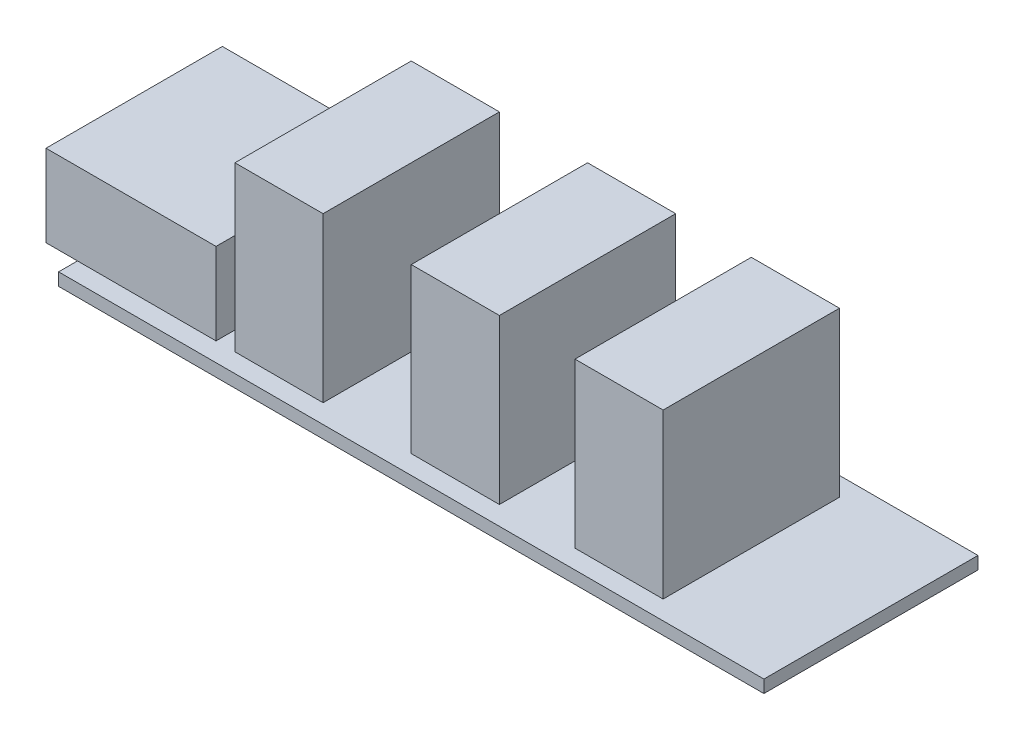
ISO-10303-21;
HEADER;
FILE_DESCRIPTION(('STEP AP214'),'2;1');
FILE_NAME('part.step','',(''),(''),'','','');
FILE_SCHEMA(('AUTOMOTIVE_DESIGN { 1 0 10303 214 1 1 1 1 }'));
ENDSEC;
DATA;
#1=APPLICATION_CONTEXT('core data for automotive mechanical design processes');
#2=APPLICATION_PROTOCOL_DEFINITION('international standard','automotive_design',2000,#1);
#3=PRODUCT_CONTEXT('',#1,'mechanical');
#4=PRODUCT('Part','Part','',(#3));
#5=PRODUCT_RELATED_PRODUCT_CATEGORY('part','',(#4));
#6=PRODUCT_DEFINITION_FORMATION('','',#4);
#7=PRODUCT_DEFINITION_CONTEXT('part definition',#1,'design');
#8=PRODUCT_DEFINITION('design','',#6,#7);
#9=PRODUCT_DEFINITION_SHAPE('','',#8);
#10=(LENGTH_UNIT() NAMED_UNIT(*) SI_UNIT(.MILLI.,.METRE.));
#11=(NAMED_UNIT(*) PLANE_ANGLE_UNIT() SI_UNIT($,.RADIAN.));
#12=(NAMED_UNIT(*) SI_UNIT($,.STERADIAN.) SOLID_ANGLE_UNIT());
#13=UNCERTAINTY_MEASURE_WITH_UNIT(LENGTH_MEASURE(1.E-05),#10,'distance_accuracy_value','');
#14=(GEOMETRIC_REPRESENTATION_CONTEXT(3) GLOBAL_UNCERTAINTY_ASSIGNED_CONTEXT((#13)) GLOBAL_UNIT_ASSIGNED_CONTEXT((#10,
#11,#12)) REPRESENTATION_CONTEXT('',''));
#15=CARTESIAN_POINT('',(0.,0.,0.));
#16=DIRECTION('',(0.,0.,1.));
#17=DIRECTION('',(1.,0.,0.));
#18=AXIS2_PLACEMENT_3D('',#15,#16,#17);
#19=CARTESIAN_POINT('',(0.,1.,0.));
#20=DIRECTION('',(0.,-1.,0.));
#21=DIRECTION('',(0.,0.,-1.));
#22=AXIS2_PLACEMENT_3D('',#19,#20,#21);
#23=PLANE('',#22);
#24=DIRECTION('',(0.,0.,1.));
#25=VECTOR('',#24,1.);
#26=CARTESIAN_POINT('',(26.5,1.,-1.50000000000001));
#27=LINE('',#26,#25);
#28=CARTESIAN_POINT('',(26.5,1.,-15.5));
#29=VERTEX_POINT('',#28);
#30=CARTESIAN_POINT('',(26.5,1.,-1.50000000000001));
#31=VERTEX_POINT('',#30);
#32=EDGE_CURVE('E237',#29,#31,#27,.T.);
#33=ORIENTED_EDGE('',*,*,#32,.F.);
#34=DIRECTION('',(-1.,0.,0.));
#35=VECTOR('',#34,1.);
#36=CARTESIAN_POINT('',(33.5,1.,-15.5));
#37=LINE('',#36,#35);
#38=CARTESIAN_POINT('',(33.5,1.,-15.5));
#39=VERTEX_POINT('',#38);
#40=EDGE_CURVE('E227',#39,#29,#37,.T.);
#41=ORIENTED_EDGE('',*,*,#40,.F.);
#42=DIRECTION('',(0.,0.,-1.));
#43=VECTOR('',#42,1.);
#44=CARTESIAN_POINT('',(33.5,1.,-1.50000000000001));
#45=LINE('',#44,#43);
#46=CARTESIAN_POINT('',(33.5,1.,-1.50000000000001));
#47=VERTEX_POINT('',#46);
#48=EDGE_CURVE('E230',#47,#39,#45,.T.);
#49=ORIENTED_EDGE('',*,*,#48,.F.);
#50=DIRECTION('',(1.,0.,0.));
#51=VECTOR('',#50,1.);
#52=CARTESIAN_POINT('',(33.5,1.,-1.50000000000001));
#53=LINE('',#52,#51);
#54=EDGE_CURVE('E234',#31,#47,#53,.T.);
#55=ORIENTED_EDGE('',*,*,#54,.F.);
#56=EDGE_LOOP('',(#33,#41,#49,#55));
#57=FACE_BOUND('',#56,.T.);
#58=DIRECTION('',(-1.,0.,0.));
#59=VECTOR('',#58,1.);
#60=CARTESIAN_POINT('',(11.,1.,-15.5));
#61=LINE('',#60,#59);
#62=CARTESIAN_POINT('',(11.,1.,-15.5));
#63=VERTEX_POINT('',#62);
#64=CARTESIAN_POINT('',(0.,1.,-15.5));
#65=VERTEX_POINT('',#64);
#66=EDGE_CURVE('E283',#63,#65,#61,.T.);
#67=ORIENTED_EDGE('',*,*,#66,.F.);
#68=DIRECTION('',(0.,0.,-1.));
#69=VECTOR('',#68,1.);
#70=CARTESIAN_POINT('',(11.,1.,-1.49999999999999));
#71=LINE('',#70,#69);
#72=CARTESIAN_POINT('',(11.,1.,-1.49999999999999));
#73=VERTEX_POINT('',#72);
#74=EDGE_CURVE('E291',#73,#63,#71,.T.);
#75=ORIENTED_EDGE('',*,*,#74,.F.);
#76=DIRECTION('',(1.,0.,0.));
#77=VECTOR('',#76,1.);
#78=CARTESIAN_POINT('',(11.,1.,-1.49999999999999));
#79=LINE('',#78,#77);
#80=CARTESIAN_POINT('',(0.,1.,-1.49999999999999));
#81=VERTEX_POINT('',#80);
#82=EDGE_CURVE('E11',#81,#73,#79,.T.);
#83=ORIENTED_EDGE('',*,*,#82,.F.);
#84=DIRECTION('',(0.,0.,1.));
#85=VECTOR('',#84,1.);
#86=CARTESIAN_POINT('',(0.,1.,0.));
#87=LINE('',#86,#85);
#88=CARTESIAN_POINT('',(0.,1.,0.));
#89=VERTEX_POINT('',#88);
#90=EDGE_CURVE('E314',#81,#89,#87,.T.);
#91=ORIENTED_EDGE('',*,*,#90,.T.);
#92=DIRECTION('',(1.,0.,0.));
#93=VECTOR('',#92,1.);
#94=CARTESIAN_POINT('',(0.,1.,0.));
#95=LINE('',#94,#93);
#96=CARTESIAN_POINT('',(56.,1.,0.));
#97=VERTEX_POINT('',#96);
#98=EDGE_CURVE('E312',#89,#97,#95,.T.);
#99=ORIENTED_EDGE('',*,*,#98,.T.);
#100=DIRECTION('',(0.,0.,-1.));
#101=VECTOR('',#100,1.);
#102=CARTESIAN_POINT('',(56.,1.,0.));
#103=LINE('',#102,#101);
#104=CARTESIAN_POINT('',(56.,1.,-17.));
#105=VERTEX_POINT('',#104);
#106=EDGE_CURVE('E316',#97,#105,#103,.T.);
#107=ORIENTED_EDGE('',*,*,#106,.T.);
#108=DIRECTION('',(-1.,0.,0.));
#109=VECTOR('',#108,1.);
#110=CARTESIAN_POINT('',(0.,1.,-17.));
#111=LINE('',#110,#109);
#112=CARTESIAN_POINT('',(0.,1.,-17.));
#113=VERTEX_POINT('',#112);
#114=EDGE_CURVE('E318',#105,#113,#111,.T.);
#115=ORIENTED_EDGE('',*,*,#114,.T.);
#116=EDGE_CURVE('E309',#113,#65,#87,.T.);
#117=ORIENTED_EDGE('',*,*,#116,.T.);
#118=EDGE_LOOP('',(#67,#75,#83,#91,#99,#107,#115,#117));
#119=FACE_BOUND('',#118,.T.);
#120=DIRECTION('',(0.,0.,1.));
#121=VECTOR('',#120,1.);
#122=CARTESIAN_POINT('',(39.5,1.,-1.50000000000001));
#123=LINE('',#122,#121);
#124=CARTESIAN_POINT('',(39.5,1.,-15.5));
#125=VERTEX_POINT('',#124);
#126=CARTESIAN_POINT('',(39.5,1.,-1.50000000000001));
#127=VERTEX_POINT('',#126);
#128=EDGE_CURVE('E217',#125,#127,#123,.T.);
#129=ORIENTED_EDGE('',*,*,#128,.F.);
#130=DIRECTION('',(-1.,0.,0.));
#131=VECTOR('',#130,1.);
#132=CARTESIAN_POINT('',(46.5,1.,-15.5));
#133=LINE('',#132,#131);
#134=CARTESIAN_POINT('',(46.5,1.,-15.5));
#135=VERTEX_POINT('',#134);
#136=EDGE_CURVE('E260',#135,#125,#133,.T.);
#137=ORIENTED_EDGE('',*,*,#136,.F.);
#138=DIRECTION('',(0.,0.,-1.));
#139=VECTOR('',#138,1.);
#140=CARTESIAN_POINT('',(46.5,1.,-1.50000000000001));
#141=LINE('',#140,#139);
#142=CARTESIAN_POINT('',(46.5,1.,-1.50000000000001));
#143=VERTEX_POINT('',#142);
#144=EDGE_CURVE('E263',#143,#135,#141,.T.);
#145=ORIENTED_EDGE('',*,*,#144,.F.);
#146=DIRECTION('',(1.,0.,0.));
#147=VECTOR('',#146,1.);
#148=CARTESIAN_POINT('',(46.5,1.,-1.50000000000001));
#149=LINE('',#148,#147);
#150=EDGE_CURVE('E267',#127,#143,#149,.T.);
#151=ORIENTED_EDGE('',*,*,#150,.F.);
#152=EDGE_LOOP('',(#129,#137,#145,#151));
#153=FACE_BOUND('',#152,.T.);
#154=DIRECTION('',(0.,0.,1.));
#155=VECTOR('',#154,1.);
#156=CARTESIAN_POINT('',(12.5,1.,-1.50000000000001));
#157=LINE('',#156,#155);
#158=CARTESIAN_POINT('',(12.5,1.,-15.5));
#159=VERTEX_POINT('',#158);
#160=CARTESIAN_POINT('',(12.5,1.,-1.50000000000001));
#161=VERTEX_POINT('',#160);
#162=EDGE_CURVE('E204',#159,#161,#157,.T.);
#163=ORIENTED_EDGE('',*,*,#162,.F.);
#164=DIRECTION('',(-1.,0.,0.));
#165=VECTOR('',#164,1.);
#166=CARTESIAN_POINT('',(19.5,1.,-15.5));
#167=LINE('',#166,#165);
#168=CARTESIAN_POINT('',(19.5,1.,-15.5));
#169=VERTEX_POINT('',#168);
#170=EDGE_CURVE('E201',#169,#159,#167,.T.);
#171=ORIENTED_EDGE('',*,*,#170,.F.);
#172=DIRECTION('',(0.,0.,-1.));
#173=VECTOR('',#172,1.);
#174=CARTESIAN_POINT('',(19.5,1.,-1.50000000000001));
#175=LINE('',#174,#173);
#176=CARTESIAN_POINT('',(19.5,1.,-1.50000000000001));
#177=VERTEX_POINT('',#176);
#178=EDGE_CURVE('E61',#177,#169,#175,.T.);
#179=ORIENTED_EDGE('',*,*,#178,.F.);
#180=DIRECTION('',(1.,0.,0.));
#181=VECTOR('',#180,1.);
#182=CARTESIAN_POINT('',(19.5,1.,-1.50000000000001));
#183=LINE('',#182,#181);
#184=EDGE_CURVE('E56',#161,#177,#183,.T.);
#185=ORIENTED_EDGE('',*,*,#184,.F.);
#186=EDGE_LOOP('',(#163,#171,#179,#185));
#187=FACE_BOUND('',#186,.T.);
#188=ADVANCED_FACE('F39',(#57,#119,#153,#187),#23,.F.);
#189=CARTESIAN_POINT('',(0.,1.,0.));
#190=DIRECTION('',(1.,0.,0.));
#191=DIRECTION('',(0.,0.,-1.));
#192=AXIS2_PLACEMENT_3D('',#189,#190,#191);
#193=PLANE('',#192);
#194=DIRECTION('',(0.,0.,1.));
#195=VECTOR('',#194,1.);
#196=CARTESIAN_POINT('',(0.,0.,0.));
#197=LINE('',#196,#195);
#198=CARTESIAN_POINT('',(0.,0.,-17.));
#199=VERTEX_POINT('',#198);
#200=CARTESIAN_POINT('',(0.,0.,0.));
#201=VERTEX_POINT('',#200);
#202=EDGE_CURVE('E308',#199,#201,#197,.T.);
#203=ORIENTED_EDGE('',*,*,#202,.T.);
#204=DIRECTION('',(0.,-1.,0.));
#205=VECTOR('',#204,1.);
#206=CARTESIAN_POINT('',(0.,1.,0.));
#207=LINE('',#206,#205);
#208=EDGE_CURVE('E43',#89,#201,#207,.T.);
#209=ORIENTED_EDGE('',*,*,#208,.F.);
#210=ORIENTED_EDGE('',*,*,#90,.F.);
#211=EDGE_CURVE('E313',#65,#81,#87,.T.);
#212=ORIENTED_EDGE('',*,*,#211,.F.);
#213=ORIENTED_EDGE('',*,*,#116,.F.);
#214=DIRECTION('',(0.,-1.,0.));
#215=VECTOR('',#214,1.);
#216=CARTESIAN_POINT('',(0.,1.,-17.));
#217=LINE('',#216,#215);
#218=EDGE_CURVE('E320',#113,#199,#217,.T.);
#219=ORIENTED_EDGE('',*,*,#218,.T.);
#220=EDGE_LOOP('',(#203,#209,#210,#212,#213,#219));
#221=FACE_BOUND('',#220,.T.);
#222=ADVANCED_FACE('F41',(#221),#193,.F.);
#223=CARTESIAN_POINT('',(0.,1.,0.));
#224=DIRECTION('',(0.,0.,-1.));
#225=DIRECTION('',(-1.,0.,0.));
#226=AXIS2_PLACEMENT_3D('',#223,#224,#225);
#227=PLANE('',#226);
#228=DIRECTION('',(1.,0.,0.));
#229=VECTOR('',#228,1.);
#230=CARTESIAN_POINT('',(0.,0.,0.));
#231=LINE('',#230,#229);
#232=CARTESIAN_POINT('',(56.,0.,0.));
#233=VERTEX_POINT('',#232);
#234=EDGE_CURVE('E323',#201,#233,#231,.T.);
#235=ORIENTED_EDGE('',*,*,#234,.T.);
#236=DIRECTION('',(0.,-1.,0.));
#237=VECTOR('',#236,1.);
#238=CARTESIAN_POINT('',(56.,1.,0.));
#239=LINE('',#238,#237);
#240=EDGE_CURVE('E333',#97,#233,#239,.T.);
#241=ORIENTED_EDGE('',*,*,#240,.F.);
#242=ORIENTED_EDGE('',*,*,#98,.F.);
#243=ORIENTED_EDGE('',*,*,#208,.T.);
#244=EDGE_LOOP('',(#235,#241,#242,#243));
#245=FACE_BOUND('',#244,.T.);
#246=ADVANCED_FACE('F343',(#245),#227,.F.);
#247=CARTESIAN_POINT('',(56.,1.,0.));
#248=DIRECTION('',(-1.,0.,0.));
#249=DIRECTION('',(0.,0.,1.));
#250=AXIS2_PLACEMENT_3D('',#247,#248,#249);
#251=PLANE('',#250);
#252=DIRECTION('',(0.,0.,-1.));
#253=VECTOR('',#252,1.);
#254=CARTESIAN_POINT('',(56.,0.,0.));
#255=LINE('',#254,#253);
#256=CARTESIAN_POINT('',(56.,0.,-17.));
#257=VERTEX_POINT('',#256);
#258=EDGE_CURVE('E325',#233,#257,#255,.T.);
#259=ORIENTED_EDGE('',*,*,#258,.T.);
#260=DIRECTION('',(0.,-1.,0.));
#261=VECTOR('',#260,1.);
#262=CARTESIAN_POINT('',(56.,1.,-17.));
#263=LINE('',#262,#261);
#264=EDGE_CURVE('E331',#105,#257,#263,.T.);
#265=ORIENTED_EDGE('',*,*,#264,.F.);
#266=ORIENTED_EDGE('',*,*,#106,.F.);
#267=ORIENTED_EDGE('',*,*,#240,.T.);
#268=EDGE_LOOP('',(#259,#265,#266,#267));
#269=FACE_BOUND('',#268,.T.);
#270=ADVANCED_FACE('F353',(#269),#251,.F.);
#271=CARTESIAN_POINT('',(0.,1.,-17.));
#272=DIRECTION('',(0.,0.,1.));
#273=DIRECTION('',(1.,0.,0.));
#274=AXIS2_PLACEMENT_3D('',#271,#272,#273);
#275=PLANE('',#274);
#276=DIRECTION('',(-1.,0.,0.));
#277=VECTOR('',#276,1.);
#278=CARTESIAN_POINT('',(0.,0.,-17.));
#279=LINE('',#278,#277);
#280=EDGE_CURVE('E327',#257,#199,#279,.T.);
#281=ORIENTED_EDGE('',*,*,#280,.T.);
#282=ORIENTED_EDGE('',*,*,#218,.F.);
#283=ORIENTED_EDGE('',*,*,#114,.F.);
#284=ORIENTED_EDGE('',*,*,#264,.T.);
#285=EDGE_LOOP('',(#281,#282,#283,#284));
#286=FACE_BOUND('',#285,.T.);
#287=ADVANCED_FACE('F356',(#286),#275,.F.);
#288=CARTESIAN_POINT('',(0.,0.,0.));
#289=DIRECTION('',(0.,-1.,0.));
#290=DIRECTION('',(0.,0.,-1.));
#291=AXIS2_PLACEMENT_3D('',#288,#289,#290);
#292=PLANE('',#291);
#293=ORIENTED_EDGE('',*,*,#202,.F.);
#294=ORIENTED_EDGE('',*,*,#280,.F.);
#295=ORIENTED_EDGE('',*,*,#258,.F.);
#296=ORIENTED_EDGE('',*,*,#234,.F.);
#297=EDGE_LOOP('',(#293,#294,#295,#296));
#298=FACE_BOUND('',#297,.T.);
#299=ADVANCED_FACE('F351',(#298),#292,.T.);
#300=CARTESIAN_POINT('',(0.,1.,0.));
#301=DIRECTION('',(0.,1.,0.));
#302=DIRECTION('',(0.,0.,1.));
#303=AXIS2_PLACEMENT_3D('',#300,#301,#302);
#304=PLANE('',#303);
#305=CARTESIAN_POINT('',(-2.5,1.,-15.5));
#306=VERTEX_POINT('',#305);
#307=EDGE_CURVE('E294',#65,#306,#61,.T.);
#308=ORIENTED_EDGE('',*,*,#307,.F.);
#309=ORIENTED_EDGE('',*,*,#211,.T.);
#310=CARTESIAN_POINT('',(-2.5,1.,-1.49999999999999));
#311=VERTEX_POINT('',#310);
#312=EDGE_CURVE('E49',#311,#81,#79,.T.);
#313=ORIENTED_EDGE('',*,*,#312,.F.);
#314=DIRECTION('',(0.,0.,1.));
#315=VECTOR('',#314,1.);
#316=CARTESIAN_POINT('',(-2.5,1.,-1.49999999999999));
#317=LINE('',#316,#315);
#318=EDGE_CURVE('E205',#306,#311,#317,.T.);
#319=ORIENTED_EDGE('',*,*,#318,.F.);
#320=EDGE_LOOP('',(#308,#309,#313,#319));
#321=FACE_BOUND('',#320,.T.);
#322=ADVANCED_FACE('F362',(#321),#304,.F.);
#323=CARTESIAN_POINT('',(-2.5,7.5,-1.49999999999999));
#324=DIRECTION('',(1.,0.,0.));
#325=DIRECTION('',(0.,0.,-1.));
#326=AXIS2_PLACEMENT_3D('',#323,#324,#325);
#327=PLANE('',#326);
#328=ORIENTED_EDGE('',*,*,#318,.T.);
#329=DIRECTION('',(0.,-1.,0.));
#330=VECTOR('',#329,1.);
#331=CARTESIAN_POINT('',(-2.5,7.5,-1.49999999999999));
#332=LINE('',#331,#330);
#333=CARTESIAN_POINT('',(-2.5,7.5,-1.49999999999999));
#334=VERTEX_POINT('',#333);
#335=EDGE_CURVE('E305',#334,#311,#332,.T.);
#336=ORIENTED_EDGE('',*,*,#335,.F.);
#337=DIRECTION('',(0.,0.,1.));
#338=VECTOR('',#337,1.);
#339=CARTESIAN_POINT('',(-2.5,7.5,-1.49999999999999));
#340=LINE('',#339,#338);
#341=CARTESIAN_POINT('',(-2.5,7.5,-15.5));
#342=VERTEX_POINT('',#341);
#343=EDGE_CURVE('E279',#342,#334,#340,.T.);
#344=ORIENTED_EDGE('',*,*,#343,.F.);
#345=DIRECTION('',(0.,-1.,0.));
#346=VECTOR('',#345,1.);
#347=CARTESIAN_POINT('',(-2.5,7.5,-15.5));
#348=LINE('',#347,#346);
#349=EDGE_CURVE('E288',#342,#306,#348,.T.);
#350=ORIENTED_EDGE('',*,*,#349,.T.);
#351=EDGE_LOOP('',(#328,#336,#344,#350));
#352=FACE_BOUND('',#351,.T.);
#353=ADVANCED_FACE('F370',(#352),#327,.F.);
#354=CARTESIAN_POINT('',(11.,7.5,-1.49999999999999));
#355=DIRECTION('',(0.,0.,-1.));
#356=DIRECTION('',(-1.,0.,0.));
#357=AXIS2_PLACEMENT_3D('',#354,#355,#356);
#358=PLANE('',#357);
#359=ORIENTED_EDGE('',*,*,#312,.T.);
#360=ORIENTED_EDGE('',*,*,#82,.T.);
#361=DIRECTION('',(0.,-1.,0.));
#362=VECTOR('',#361,1.);
#363=CARTESIAN_POINT('',(11.,7.5,-1.49999999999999));
#364=LINE('',#363,#362);
#365=CARTESIAN_POINT('',(11.,7.5,-1.49999999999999));
#366=VERTEX_POINT('',#365);
#367=EDGE_CURVE('E302',#366,#73,#364,.T.);
#368=ORIENTED_EDGE('',*,*,#367,.F.);
#369=DIRECTION('',(1.,0.,0.));
#370=VECTOR('',#369,1.);
#371=CARTESIAN_POINT('',(11.,7.5,-1.49999999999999));
#372=LINE('',#371,#370);
#373=EDGE_CURVE('E282',#334,#366,#372,.T.);
#374=ORIENTED_EDGE('',*,*,#373,.F.);
#375=ORIENTED_EDGE('',*,*,#335,.T.);
#376=EDGE_LOOP('',(#359,#360,#368,#374,#375));
#377=FACE_BOUND('',#376,.T.);
#378=ADVANCED_FACE('F365',(#377),#358,.F.);
#379=CARTESIAN_POINT('',(11.,7.5,-1.49999999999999));
#380=DIRECTION('',(-1.,0.,0.));
#381=DIRECTION('',(0.,0.,1.));
#382=AXIS2_PLACEMENT_3D('',#379,#380,#381);
#383=PLANE('',#382);
#384=ORIENTED_EDGE('',*,*,#74,.T.);
#385=DIRECTION('',(0.,-1.,0.));
#386=VECTOR('',#385,1.);
#387=CARTESIAN_POINT('',(11.,7.5,-15.5));
#388=LINE('',#387,#386);
#389=CARTESIAN_POINT('',(11.,7.5,-15.5));
#390=VERTEX_POINT('',#389);
#391=EDGE_CURVE('E299',#390,#63,#388,.T.);
#392=ORIENTED_EDGE('',*,*,#391,.F.);
#393=DIRECTION('',(0.,0.,-1.));
#394=VECTOR('',#393,1.);
#395=CARTESIAN_POINT('',(11.,7.5,-1.49999999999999));
#396=LINE('',#395,#394);
#397=EDGE_CURVE('E285',#366,#390,#396,.T.);
#398=ORIENTED_EDGE('',*,*,#397,.F.);
#399=ORIENTED_EDGE('',*,*,#367,.T.);
#400=EDGE_LOOP('',(#384,#392,#398,#399));
#401=FACE_BOUND('',#400,.T.);
#402=ADVANCED_FACE('F377',(#401),#383,.F.);
#403=CARTESIAN_POINT('',(11.,7.5,-15.5));
#404=DIRECTION('',(0.,0.,1.));
#405=DIRECTION('',(1.,0.,0.));
#406=AXIS2_PLACEMENT_3D('',#403,#404,#405);
#407=PLANE('',#406);
#408=ORIENTED_EDGE('',*,*,#66,.T.);
#409=ORIENTED_EDGE('',*,*,#307,.T.);
#410=ORIENTED_EDGE('',*,*,#349,.F.);
#411=DIRECTION('',(-1.,0.,0.));
#412=VECTOR('',#411,1.);
#413=CARTESIAN_POINT('',(11.,7.5,-15.5));
#414=LINE('',#413,#412);
#415=EDGE_CURVE('E287',#390,#342,#414,.T.);
#416=ORIENTED_EDGE('',*,*,#415,.F.);
#417=ORIENTED_EDGE('',*,*,#391,.T.);
#418=EDGE_LOOP('',(#408,#409,#410,#416,#417));
#419=FACE_BOUND('',#418,.T.);
#420=ADVANCED_FACE('F374',(#419),#407,.F.);
#421=CARTESIAN_POINT('',(0.,7.5,0.));
#422=DIRECTION('',(0.,1.,0.));
#423=DIRECTION('',(0.,0.,1.));
#424=AXIS2_PLACEMENT_3D('',#421,#422,#423);
#425=PLANE('',#424);
#426=ORIENTED_EDGE('',*,*,#343,.T.);
#427=ORIENTED_EDGE('',*,*,#373,.T.);
#428=ORIENTED_EDGE('',*,*,#397,.T.);
#429=ORIENTED_EDGE('',*,*,#415,.T.);
#430=EDGE_LOOP('',(#426,#427,#428,#429));
#431=FACE_BOUND('',#430,.T.);
#432=ADVANCED_FACE('F380',(#431),#425,.T.);
#433=CARTESIAN_POINT('',(39.5,14.,-1.50000000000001));
#434=DIRECTION('',(1.,0.,0.));
#435=DIRECTION('',(0.,0.,-1.));
#436=AXIS2_PLACEMENT_3D('',#433,#434,#435);
#437=PLANE('',#436);
#438=ORIENTED_EDGE('',*,*,#128,.T.);
#439=DIRECTION('',(0.,-1.,0.));
#440=VECTOR('',#439,1.);
#441=CARTESIAN_POINT('',(39.5,14.,-1.50000000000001));
#442=LINE('',#441,#440);
#443=CARTESIAN_POINT('',(39.5,14.,-1.50000000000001));
#444=VERTEX_POINT('',#443);
#445=EDGE_CURVE('E247',#444,#127,#442,.T.);
#446=ORIENTED_EDGE('',*,*,#445,.F.);
#447=DIRECTION('',(0.,0.,1.));
#448=VECTOR('',#447,1.);
#449=CARTESIAN_POINT('',(39.5,14.,-1.50000000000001));
#450=LINE('',#449,#448);
#451=CARTESIAN_POINT('',(39.5,14.,-15.5));
#452=VERTEX_POINT('',#451);
#453=EDGE_CURVE('E264',#452,#444,#450,.T.);
#454=ORIENTED_EDGE('',*,*,#453,.F.);
#455=DIRECTION('',(0.,-1.,0.));
#456=VECTOR('',#455,1.);
#457=CARTESIAN_POINT('',(39.5,14.,-15.5));
#458=LINE('',#457,#456);
#459=EDGE_CURVE('E256',#452,#125,#458,.T.);
#460=ORIENTED_EDGE('',*,*,#459,.T.);
#461=EDGE_LOOP('',(#438,#446,#454,#460));
#462=FACE_BOUND('',#461,.T.);
#463=ADVANCED_FACE('F382',(#462),#437,.F.);
#464=CARTESIAN_POINT('',(46.5,14.,-1.50000000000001));
#465=DIRECTION('',(0.,0.,-1.));
#466=DIRECTION('',(-1.,0.,0.));
#467=AXIS2_PLACEMENT_3D('',#464,#465,#466);
#468=PLANE('',#467);
#469=ORIENTED_EDGE('',*,*,#150,.T.);
#470=DIRECTION('',(0.,-1.,0.));
#471=VECTOR('',#470,1.);
#472=CARTESIAN_POINT('',(46.5,14.,-1.50000000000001));
#473=LINE('',#472,#471);
#474=CARTESIAN_POINT('',(46.5,14.,-1.50000000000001));
#475=VERTEX_POINT('',#474);
#476=EDGE_CURVE('E250',#475,#143,#473,.T.);
#477=ORIENTED_EDGE('',*,*,#476,.F.);
#478=DIRECTION('',(1.,0.,0.));
#479=VECTOR('',#478,1.);
#480=CARTESIAN_POINT('',(46.5,14.,-1.50000000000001));
#481=LINE('',#480,#479);
#482=EDGE_CURVE('E275',#444,#475,#481,.T.);
#483=ORIENTED_EDGE('',*,*,#482,.F.);
#484=ORIENTED_EDGE('',*,*,#445,.T.);
#485=EDGE_LOOP('',(#469,#477,#483,#484));
#486=FACE_BOUND('',#485,.T.);
#487=ADVANCED_FACE('F389',(#486),#468,.F.);
#488=CARTESIAN_POINT('',(46.5,14.,-1.50000000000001));
#489=DIRECTION('',(-1.,0.,0.));
#490=DIRECTION('',(0.,0.,1.));
#491=AXIS2_PLACEMENT_3D('',#488,#489,#490);
#492=PLANE('',#491);
#493=ORIENTED_EDGE('',*,*,#144,.T.);
#494=DIRECTION('',(0.,-1.,0.));
#495=VECTOR('',#494,1.);
#496=CARTESIAN_POINT('',(46.5,14.,-15.5));
#497=LINE('',#496,#495);
#498=CARTESIAN_POINT('',(46.5,14.,-15.5));
#499=VERTEX_POINT('',#498);
#500=EDGE_CURVE('E253',#499,#135,#497,.T.);
#501=ORIENTED_EDGE('',*,*,#500,.F.);
#502=DIRECTION('',(0.,0.,-1.));
#503=VECTOR('',#502,1.);
#504=CARTESIAN_POINT('',(46.5,14.,-1.50000000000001));
#505=LINE('',#504,#503);
#506=EDGE_CURVE('E273',#475,#499,#505,.T.);
#507=ORIENTED_EDGE('',*,*,#506,.F.);
#508=ORIENTED_EDGE('',*,*,#476,.T.);
#509=EDGE_LOOP('',(#493,#501,#507,#508));
#510=FACE_BOUND('',#509,.T.);
#511=ADVANCED_FACE('F485',(#510),#492,.F.);
#512=CARTESIAN_POINT('',(46.5,14.,-15.5));
#513=DIRECTION('',(0.,0.,1.));
#514=DIRECTION('',(1.,0.,0.));
#515=AXIS2_PLACEMENT_3D('',#512,#513,#514);
#516=PLANE('',#515);
#517=ORIENTED_EDGE('',*,*,#136,.T.);
#518=ORIENTED_EDGE('',*,*,#459,.F.);
#519=DIRECTION('',(-1.,0.,0.));
#520=VECTOR('',#519,1.);
#521=CARTESIAN_POINT('',(46.5,14.,-15.5));
#522=LINE('',#521,#520);
#523=EDGE_CURVE('E259',#499,#452,#522,.T.);
#524=ORIENTED_EDGE('',*,*,#523,.F.);
#525=ORIENTED_EDGE('',*,*,#500,.T.);
#526=EDGE_LOOP('',(#517,#518,#524,#525));
#527=FACE_BOUND('',#526,.T.);
#528=ADVANCED_FACE('F495',(#527),#516,.F.);
#529=CARTESIAN_POINT('',(0.,14.,0.));
#530=DIRECTION('',(0.,1.,0.));
#531=DIRECTION('',(0.,0.,1.));
#532=AXIS2_PLACEMENT_3D('',#529,#530,#531);
#533=PLANE('',#532);
#534=ORIENTED_EDGE('',*,*,#453,.T.);
#535=ORIENTED_EDGE('',*,*,#482,.T.);
#536=ORIENTED_EDGE('',*,*,#506,.T.);
#537=ORIENTED_EDGE('',*,*,#523,.T.);
#538=EDGE_LOOP('',(#534,#535,#536,#537));
#539=FACE_BOUND('',#538,.T.);
#540=ADVANCED_FACE('F505',(#539),#533,.T.);
#541=CARTESIAN_POINT('',(26.5,14.,-1.50000000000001));
#542=DIRECTION('',(1.,0.,0.));
#543=DIRECTION('',(0.,0.,-1.));
#544=AXIS2_PLACEMENT_3D('',#541,#542,#543);
#545=PLANE('',#544);
#546=ORIENTED_EDGE('',*,*,#32,.T.);
#547=DIRECTION('',(0.,-1.,0.));
#548=VECTOR('',#547,1.);
#549=CARTESIAN_POINT('',(26.5,14.,-1.50000000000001));
#550=LINE('',#549,#548);
#551=CARTESIAN_POINT('',(26.5,14.,-1.50000000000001));
#552=VERTEX_POINT('',#551);
#553=EDGE_CURVE('E213',#552,#31,#550,.T.);
#554=ORIENTED_EDGE('',*,*,#553,.F.);
#555=DIRECTION('',(0.,0.,1.));
#556=VECTOR('',#555,1.);
#557=CARTESIAN_POINT('',(26.5,14.,-1.50000000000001));
#558=LINE('',#557,#556);
#559=CARTESIAN_POINT('',(26.5,14.,-15.5));
#560=VERTEX_POINT('',#559);
#561=EDGE_CURVE('E231',#560,#552,#558,.T.);
#562=ORIENTED_EDGE('',*,*,#561,.F.);
#563=DIRECTION('',(0.,-1.,0.));
#564=VECTOR('',#563,1.);
#565=CARTESIAN_POINT('',(26.5,14.,-15.5));
#566=LINE('',#565,#564);
#567=EDGE_CURVE('E223',#560,#29,#566,.T.);
#568=ORIENTED_EDGE('',*,*,#567,.T.);
#569=EDGE_LOOP('',(#546,#554,#562,#568));
#570=FACE_BOUND('',#569,.T.);
#571=ADVANCED_FACE('F515',(#570),#545,.F.);
#572=CARTESIAN_POINT('',(33.5,14.,-1.50000000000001));
#573=DIRECTION('',(0.,0.,-1.));
#574=DIRECTION('',(-1.,0.,0.));
#575=AXIS2_PLACEMENT_3D('',#572,#573,#574);
#576=PLANE('',#575);
#577=ORIENTED_EDGE('',*,*,#54,.T.);
#578=DIRECTION('',(0.,-1.,0.));
#579=VECTOR('',#578,1.);
#580=CARTESIAN_POINT('',(33.5,14.,-1.50000000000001));
#581=LINE('',#580,#579);
#582=CARTESIAN_POINT('',(33.5,14.,-1.50000000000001));
#583=VERTEX_POINT('',#582);
#584=EDGE_CURVE('E216',#583,#47,#581,.T.);
#585=ORIENTED_EDGE('',*,*,#584,.F.);
#586=DIRECTION('',(1.,0.,0.));
#587=VECTOR('',#586,1.);
#588=CARTESIAN_POINT('',(33.5,14.,-1.50000000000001));
#589=LINE('',#588,#587);
#590=EDGE_CURVE('E243',#552,#583,#589,.T.);
#591=ORIENTED_EDGE('',*,*,#590,.F.);
#592=ORIENTED_EDGE('',*,*,#553,.T.);
#593=EDGE_LOOP('',(#577,#585,#591,#592));
#594=FACE_BOUND('',#593,.T.);
#595=ADVANCED_FACE('F524',(#594),#576,.F.);
#596=CARTESIAN_POINT('',(33.5,14.,-1.50000000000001));
#597=DIRECTION('',(-1.,0.,0.));
#598=DIRECTION('',(0.,0.,1.));
#599=AXIS2_PLACEMENT_3D('',#596,#597,#598);
#600=PLANE('',#599);
#601=ORIENTED_EDGE('',*,*,#48,.T.);
#602=DIRECTION('',(0.,-1.,0.));
#603=VECTOR('',#602,1.);
#604=CARTESIAN_POINT('',(33.5,14.,-15.5));
#605=LINE('',#604,#603);
#606=CARTESIAN_POINT('',(33.5,14.,-15.5));
#607=VERTEX_POINT('',#606);
#608=EDGE_CURVE('E220',#607,#39,#605,.T.);
#609=ORIENTED_EDGE('',*,*,#608,.F.);
#610=DIRECTION('',(0.,0.,-1.));
#611=VECTOR('',#610,1.);
#612=CARTESIAN_POINT('',(33.5,14.,-1.50000000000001));
#613=LINE('',#612,#611);
#614=EDGE_CURVE('E241',#583,#607,#613,.T.);
#615=ORIENTED_EDGE('',*,*,#614,.F.);
#616=ORIENTED_EDGE('',*,*,#584,.T.);
#617=EDGE_LOOP('',(#601,#609,#615,#616));
#618=FACE_BOUND('',#617,.T.);
#619=ADVANCED_FACE('F534',(#618),#600,.F.);
#620=CARTESIAN_POINT('',(33.5,14.,-15.5));
#621=DIRECTION('',(0.,0.,1.));
#622=DIRECTION('',(1.,0.,0.));
#623=AXIS2_PLACEMENT_3D('',#620,#621,#622);
#624=PLANE('',#623);
#625=ORIENTED_EDGE('',*,*,#40,.T.);
#626=ORIENTED_EDGE('',*,*,#567,.F.);
#627=DIRECTION('',(-1.,0.,0.));
#628=VECTOR('',#627,1.);
#629=CARTESIAN_POINT('',(33.5,14.,-15.5));
#630=LINE('',#629,#628);
#631=EDGE_CURVE('E226',#607,#560,#630,.T.);
#632=ORIENTED_EDGE('',*,*,#631,.F.);
#633=ORIENTED_EDGE('',*,*,#608,.T.);
#634=EDGE_LOOP('',(#625,#626,#632,#633));
#635=FACE_BOUND('',#634,.T.);
#636=ADVANCED_FACE('F544',(#635),#624,.F.);
#637=CARTESIAN_POINT('',(0.,14.,0.));
#638=DIRECTION('',(0.,1.,0.));
#639=DIRECTION('',(0.,0.,1.));
#640=AXIS2_PLACEMENT_3D('',#637,#638,#639);
#641=PLANE('',#640);
#642=ORIENTED_EDGE('',*,*,#561,.T.);
#643=ORIENTED_EDGE('',*,*,#590,.T.);
#644=ORIENTED_EDGE('',*,*,#614,.T.);
#645=ORIENTED_EDGE('',*,*,#631,.T.);
#646=EDGE_LOOP('',(#642,#643,#644,#645));
#647=FACE_BOUND('',#646,.T.);
#648=ADVANCED_FACE('F554',(#647),#641,.T.);
#649=CARTESIAN_POINT('',(12.5,14.,-1.50000000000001));
#650=DIRECTION('',(1.,0.,0.));
#651=DIRECTION('',(0.,0.,-1.));
#652=AXIS2_PLACEMENT_3D('',#649,#650,#651);
#653=PLANE('',#652);
#654=ORIENTED_EDGE('',*,*,#162,.T.);
#655=DIRECTION('',(0.,-1.,0.));
#656=VECTOR('',#655,1.);
#657=CARTESIAN_POINT('',(12.5,14.,-1.50000000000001));
#658=LINE('',#657,#656);
#659=CARTESIAN_POINT('',(12.5,14.,-1.50000000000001));
#660=VERTEX_POINT('',#659);
#661=EDGE_CURVE('E185',#660,#161,#658,.T.);
#662=ORIENTED_EDGE('',*,*,#661,.F.);
#663=DIRECTION('',(0.,0.,1.));
#664=VECTOR('',#663,1.);
#665=CARTESIAN_POINT('',(12.5,14.,-1.50000000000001));
#666=LINE('',#665,#664);
#667=CARTESIAN_POINT('',(12.5,14.,-15.5));
#668=VERTEX_POINT('',#667);
#669=EDGE_CURVE('E192',#668,#660,#666,.T.);
#670=ORIENTED_EDGE('',*,*,#669,.F.);
#671=DIRECTION('',(0.,-1.,0.));
#672=VECTOR('',#671,1.);
#673=CARTESIAN_POINT('',(12.5,14.,-15.5));
#674=LINE('',#673,#672);
#675=EDGE_CURVE('E613',#668,#159,#674,.T.);
#676=ORIENTED_EDGE('',*,*,#675,.T.);
#677=EDGE_LOOP('',(#654,#662,#670,#676));
#678=FACE_BOUND('',#677,.T.);
#679=ADVANCED_FACE('F203',(#678),#653,.F.);
#680=CARTESIAN_POINT('',(19.5,14.,-1.50000000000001));
#681=DIRECTION('',(0.,0.,-1.));
#682=DIRECTION('',(-1.,0.,0.));
#683=AXIS2_PLACEMENT_3D('',#680,#681,#682);
#684=PLANE('',#683);
#685=ORIENTED_EDGE('',*,*,#184,.T.);
#686=DIRECTION('',(0.,-1.,0.));
#687=VECTOR('',#686,1.);
#688=CARTESIAN_POINT('',(19.5,14.,-1.50000000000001));
#689=LINE('',#688,#687);
#690=CARTESIAN_POINT('',(19.5,14.,-1.50000000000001));
#691=VERTEX_POINT('',#690);
#692=EDGE_CURVE('E188',#691,#177,#689,.T.);
#693=ORIENTED_EDGE('',*,*,#692,.F.);
#694=DIRECTION('',(1.,0.,0.));
#695=VECTOR('',#694,1.);
#696=CARTESIAN_POINT('',(19.5,14.,-1.50000000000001));
#697=LINE('',#696,#695);
#698=EDGE_CURVE('E181',#660,#691,#697,.T.);
#699=ORIENTED_EDGE('',*,*,#698,.F.);
#700=ORIENTED_EDGE('',*,*,#661,.T.);
#701=EDGE_LOOP('',(#685,#693,#699,#700));
#702=FACE_BOUND('',#701,.T.);
#703=ADVANCED_FACE('F183',(#702),#684,.F.);
#704=CARTESIAN_POINT('',(19.5,14.,-1.50000000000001));
#705=DIRECTION('',(-1.,0.,0.));
#706=DIRECTION('',(0.,0.,1.));
#707=AXIS2_PLACEMENT_3D('',#704,#705,#706);
#708=PLANE('',#707);
#709=ORIENTED_EDGE('',*,*,#178,.T.);
#710=DIRECTION('',(0.,-1.,0.));
#711=VECTOR('',#710,1.);
#712=CARTESIAN_POINT('',(19.5,14.,-15.5));
#713=LINE('',#712,#711);
#714=CARTESIAN_POINT('',(19.5,14.,-15.5));
#715=VERTEX_POINT('',#714);
#716=EDGE_CURVE('E209',#715,#169,#713,.T.);
#717=ORIENTED_EDGE('',*,*,#716,.F.);
#718=DIRECTION('',(0.,0.,-1.));
#719=VECTOR('',#718,1.);
#720=CARTESIAN_POINT('',(19.5,14.,-1.50000000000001));
#721=LINE('',#720,#719);
#722=EDGE_CURVE('E191',#691,#715,#721,.T.);
#723=ORIENTED_EDGE('',*,*,#722,.F.);
#724=ORIENTED_EDGE('',*,*,#692,.T.);
#725=EDGE_LOOP('',(#709,#717,#723,#724));
#726=FACE_BOUND('',#725,.T.);
#727=ADVANCED_FACE('F581',(#726),#708,.F.);
#728=CARTESIAN_POINT('',(19.5,14.,-15.5));
#729=DIRECTION('',(0.,0.,1.));
#730=DIRECTION('',(1.,0.,0.));
#731=AXIS2_PLACEMENT_3D('',#728,#729,#730);
#732=PLANE('',#731);
#733=ORIENTED_EDGE('',*,*,#170,.T.);
#734=ORIENTED_EDGE('',*,*,#675,.F.);
#735=DIRECTION('',(-1.,0.,0.));
#736=VECTOR('',#735,1.);
#737=CARTESIAN_POINT('',(19.5,14.,-15.5));
#738=LINE('',#737,#736);
#739=EDGE_CURVE('E197',#715,#668,#738,.T.);
#740=ORIENTED_EDGE('',*,*,#739,.F.);
#741=ORIENTED_EDGE('',*,*,#716,.T.);
#742=EDGE_LOOP('',(#733,#734,#740,#741));
#743=FACE_BOUND('',#742,.T.);
#744=ADVANCED_FACE('F590',(#743),#732,.F.);
#745=CARTESIAN_POINT('',(0.,14.,0.));
#746=DIRECTION('',(0.,1.,0.));
#747=DIRECTION('',(0.,0.,1.));
#748=AXIS2_PLACEMENT_3D('',#745,#746,#747);
#749=PLANE('',#748);
#750=ORIENTED_EDGE('',*,*,#669,.T.);
#751=ORIENTED_EDGE('',*,*,#698,.T.);
#752=ORIENTED_EDGE('',*,*,#722,.T.);
#753=ORIENTED_EDGE('',*,*,#739,.T.);
#754=EDGE_LOOP('',(#750,#751,#752,#753));
#755=FACE_BOUND('',#754,.T.);
#756=ADVANCED_FACE('F195',(#755),#749,.T.);
#757=CLOSED_SHELL('',(#188,#222,#246,#270,#287,#299,#322,#353,#378,#402,#420,#432,#463,#487,
#511,#528,#540,#571,#595,#619,#636,#648,#679,#703,#727,#744,#756));
#758=MANIFOLD_SOLID_BREP('B2',#757);
#759=ADVANCED_BREP_SHAPE_REPRESENTATION('',(#18,#758),#14);
#760=SHAPE_DEFINITION_REPRESENTATION(#9,#759);
ENDSEC;
END-ISO-10303-21;
